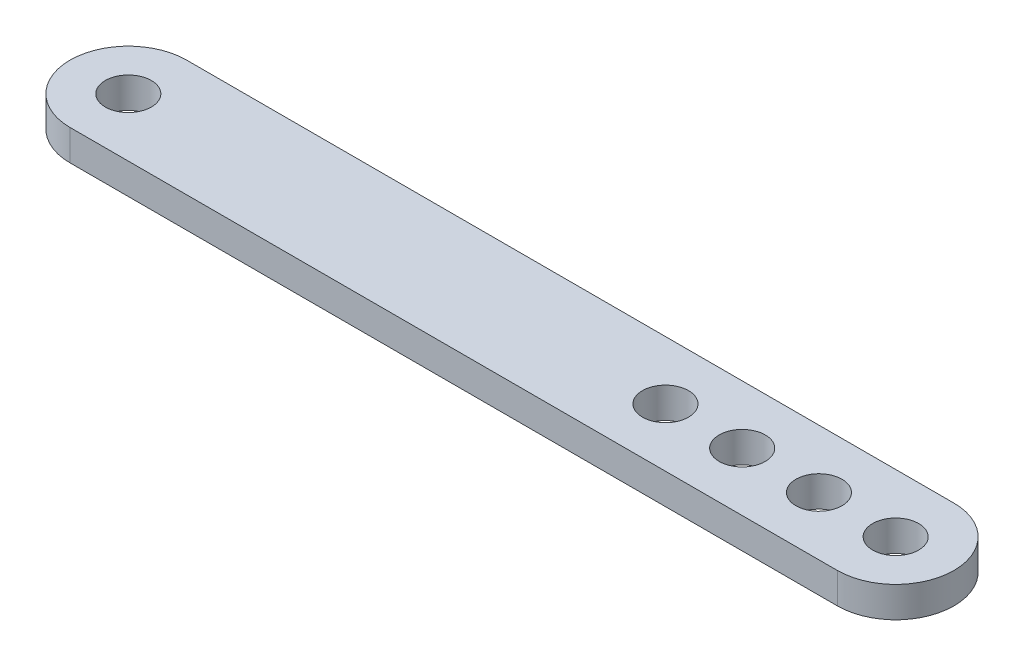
ISO-10303-21;
HEADER;
FILE_DESCRIPTION(('STEP AP214'),'2;1');
FILE_NAME('part.step','',(''),(''),'','','');
FILE_SCHEMA(('AUTOMOTIVE_DESIGN { 1 0 10303 214 1 1 1 1 }'));
ENDSEC;
DATA;
#1=APPLICATION_CONTEXT('core data for automotive mechanical design processes');
#2=APPLICATION_PROTOCOL_DEFINITION('international standard','automotive_design',2000,#1);
#3=PRODUCT_CONTEXT('',#1,'mechanical');
#4=PRODUCT('Part','Part','',(#3));
#5=PRODUCT_RELATED_PRODUCT_CATEGORY('part','',(#4));
#6=PRODUCT_DEFINITION_FORMATION('','',#4);
#7=PRODUCT_DEFINITION_CONTEXT('part definition',#1,'design');
#8=PRODUCT_DEFINITION('design','',#6,#7);
#9=PRODUCT_DEFINITION_SHAPE('','',#8);
#10=(LENGTH_UNIT() NAMED_UNIT(*) SI_UNIT(.MILLI.,.METRE.));
#11=(NAMED_UNIT(*) PLANE_ANGLE_UNIT() SI_UNIT($,.RADIAN.));
#12=(NAMED_UNIT(*) SI_UNIT($,.STERADIAN.) SOLID_ANGLE_UNIT());
#13=UNCERTAINTY_MEASURE_WITH_UNIT(LENGTH_MEASURE(1.E-05),#10,'distance_accuracy_value','');
#14=(GEOMETRIC_REPRESENTATION_CONTEXT(3) GLOBAL_UNCERTAINTY_ASSIGNED_CONTEXT((#13)) GLOBAL_UNIT_ASSIGNED_CONTEXT((#10,
#11,#12)) REPRESENTATION_CONTEXT('',''));
#15=CARTESIAN_POINT('',(0.,0.,0.));
#16=DIRECTION('',(0.,0.,1.));
#17=DIRECTION('',(1.,0.,0.));
#18=AXIS2_PLACEMENT_3D('',#15,#16,#17);
#19=CARTESIAN_POINT('',(0.,2.,3.8));
#20=DIRECTION('',(0.,0.,1.));
#21=DIRECTION('',(1.,0.,0.));
#22=AXIS2_PLACEMENT_3D('',#19,#20,#21);
#23=PLANE('',#22);
#24=DIRECTION('',(-1.,0.,0.));
#25=VECTOR('',#24,1.);
#26=CARTESIAN_POINT('',(0.,0.,3.8));
#27=LINE('',#26,#25);
#28=CARTESIAN_POINT('',(25.,0.,3.8));
#29=VERTEX_POINT('',#28);
#30=CARTESIAN_POINT('',(-25.,0.,3.8));
#31=VERTEX_POINT('',#30);
#32=EDGE_CURVE('E125',#29,#31,#27,.T.);
#33=ORIENTED_EDGE('',*,*,#32,.F.);
#34=DIRECTION('',(0.,-1.,0.));
#35=VECTOR('',#34,1.);
#36=CARTESIAN_POINT('',(25.,2.,3.8));
#37=LINE('',#36,#35);
#38=CARTESIAN_POINT('',(25.,2.,3.8));
#39=VERTEX_POINT('',#38);
#40=EDGE_CURVE('E11',#39,#29,#37,.T.);
#41=ORIENTED_EDGE('',*,*,#40,.F.);
#42=DIRECTION('',(-1.,0.,0.));
#43=VECTOR('',#42,1.);
#44=CARTESIAN_POINT('',(0.,2.,3.8));
#45=LINE('',#44,#43);
#46=CARTESIAN_POINT('',(-25.,2.,3.8));
#47=VERTEX_POINT('',#46);
#48=EDGE_CURVE('E104',#39,#47,#45,.T.);
#49=ORIENTED_EDGE('',*,*,#48,.T.);
#50=DIRECTION('',(0.,-1.,0.));
#51=VECTOR('',#50,1.);
#52=CARTESIAN_POINT('',(-25.,2.,3.8));
#53=LINE('',#52,#51);
#54=EDGE_CURVE('E85',#47,#31,#53,.T.);
#55=ORIENTED_EDGE('',*,*,#54,.T.);
#56=EDGE_LOOP('',(#33,#41,#49,#55));
#57=FACE_BOUND('',#56,.T.);
#58=ADVANCED_FACE('F45',(#57),#23,.T.);
#59=CARTESIAN_POINT('',(25.,2.,0.));
#60=DIRECTION('',(0.,-1.,0.));
#61=DIRECTION('',(0.,0.,-1.));
#62=AXIS2_PLACEMENT_3D('',#59,#60,#61);
#63=CYLINDRICAL_SURFACE('',#62,3.8);
#64=CARTESIAN_POINT('',(25.,0.,0.));
#65=DIRECTION('',(0.,1.,0.));
#66=DIRECTION('',(0.,0.,1.));
#67=AXIS2_PLACEMENT_3D('',#64,#65,#66);
#68=CIRCLE('',#67,3.8);
#69=CARTESIAN_POINT('',(25.,0.,-3.8));
#70=VERTEX_POINT('',#69);
#71=EDGE_CURVE('E110',#29,#70,#68,.T.);
#72=ORIENTED_EDGE('',*,*,#71,.T.);
#73=DIRECTION('',(0.,-1.,0.));
#74=VECTOR('',#73,1.);
#75=CARTESIAN_POINT('',(25.,2.,-3.8));
#76=LINE('',#75,#74);
#77=CARTESIAN_POINT('',(25.,2.,-3.8));
#78=VERTEX_POINT('',#77);
#79=EDGE_CURVE('E55',#78,#70,#76,.T.);
#80=ORIENTED_EDGE('',*,*,#79,.F.);
#81=CARTESIAN_POINT('',(25.,2.,0.));
#82=DIRECTION('',(0.,1.,0.));
#83=DIRECTION('',(0.,0.,1.));
#84=AXIS2_PLACEMENT_3D('',#81,#82,#83);
#85=CIRCLE('',#84,3.8);
#86=EDGE_CURVE('E101',#39,#78,#85,.T.);
#87=ORIENTED_EDGE('',*,*,#86,.F.);
#88=ORIENTED_EDGE('',*,*,#40,.T.);
#89=EDGE_LOOP('',(#72,#80,#87,#88));
#90=FACE_BOUND('',#89,.T.);
#91=ADVANCED_FACE('F108',(#90),#63,.T.);
#92=CARTESIAN_POINT('',(0.,2.,-3.8));
#93=DIRECTION('',(0.,0.,1.));
#94=DIRECTION('',(1.,0.,0.));
#95=AXIS2_PLACEMENT_3D('',#92,#93,#94);
#96=PLANE('',#95);
#97=DIRECTION('',(-1.,0.,0.));
#98=VECTOR('',#97,1.);
#99=CARTESIAN_POINT('',(0.,0.,-3.8));
#100=LINE('',#99,#98);
#101=CARTESIAN_POINT('',(-25.,0.,-3.8));
#102=VERTEX_POINT('',#101);
#103=EDGE_CURVE('E120',#70,#102,#100,.T.);
#104=ORIENTED_EDGE('',*,*,#103,.T.);
#105=DIRECTION('',(0.,-1.,0.));
#106=VECTOR('',#105,1.);
#107=CARTESIAN_POINT('',(-25.,2.,-3.8));
#108=LINE('',#107,#106);
#109=CARTESIAN_POINT('',(-25.,2.,-3.8));
#110=VERTEX_POINT('',#109);
#111=EDGE_CURVE('E99',#110,#102,#108,.T.);
#112=ORIENTED_EDGE('',*,*,#111,.F.);
#113=DIRECTION('',(-1.,0.,0.));
#114=VECTOR('',#113,1.);
#115=CARTESIAN_POINT('',(0.,2.,-3.8));
#116=LINE('',#115,#114);
#117=EDGE_CURVE('E93',#78,#110,#116,.T.);
#118=ORIENTED_EDGE('',*,*,#117,.F.);
#119=ORIENTED_EDGE('',*,*,#79,.T.);
#120=EDGE_LOOP('',(#104,#112,#118,#119));
#121=FACE_BOUND('',#120,.T.);
#122=ADVANCED_FACE('F96',(#121),#96,.F.);
#123=CARTESIAN_POINT('',(15.,2.,0.));
#124=DIRECTION('',(0.,-1.,0.));
#125=DIRECTION('',(0.,0.,-1.));
#126=AXIS2_PLACEMENT_3D('',#123,#124,#125);
#127=CYLINDRICAL_SURFACE('',#126,1.5);
#128=CARTESIAN_POINT('',(15.,2.,0.));
#129=DIRECTION('',(0.,1.,0.));
#130=DIRECTION('',(0.,0.,1.));
#131=AXIS2_PLACEMENT_3D('',#128,#129,#130);
#132=CIRCLE('',#131,1.5);
#133=CARTESIAN_POINT('',(15.,2.,1.50000000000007));
#134=VERTEX_POINT('',#133);
#135=EDGE_CURVE('E152',#134,#134,#132,.T.);
#136=ORIENTED_EDGE('',*,*,#135,.T.);
#137=EDGE_LOOP('',(#136));
#138=FACE_BOUND('',#137,.T.);
#139=CARTESIAN_POINT('',(15.,0.,0.));
#140=DIRECTION('',(0.,1.,0.));
#141=DIRECTION('',(0.,0.,1.));
#142=AXIS2_PLACEMENT_3D('',#139,#140,#141);
#143=CIRCLE('',#142,1.5);
#144=CARTESIAN_POINT('',(15.,0.,1.50000000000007));
#145=VERTEX_POINT('',#144);
#146=EDGE_CURVE('E128',#145,#145,#143,.T.);
#147=ORIENTED_EDGE('',*,*,#146,.F.);
#148=EDGE_LOOP('',(#147));
#149=FACE_BOUND('',#148,.T.);
#150=ADVANCED_FACE('F187',(#138,#149),#127,.F.);
#151=CARTESIAN_POINT('',(10.,2.,1.07310574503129E-13));
#152=DIRECTION('',(0.,-1.,0.));
#153=DIRECTION('',(0.,0.,-1.));
#154=AXIS2_PLACEMENT_3D('',#151,#152,#153);
#155=CYLINDRICAL_SURFACE('',#154,1.5);
#156=CARTESIAN_POINT('',(10.,2.,1.07310574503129E-13));
#157=DIRECTION('',(0.,1.,0.));
#158=DIRECTION('',(0.,0.,1.));
#159=AXIS2_PLACEMENT_3D('',#156,#157,#158);
#160=CIRCLE('',#159,1.5);
#161=CARTESIAN_POINT('',(10.,2.,1.50000000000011));
#162=VERTEX_POINT('',#161);
#163=EDGE_CURVE('E156',#162,#162,#160,.T.);
#164=ORIENTED_EDGE('',*,*,#163,.T.);
#165=EDGE_LOOP('',(#164));
#166=FACE_BOUND('',#165,.T.);
#167=CARTESIAN_POINT('',(10.,0.,1.07310574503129E-13));
#168=DIRECTION('',(0.,1.,0.));
#169=DIRECTION('',(0.,0.,1.));
#170=AXIS2_PLACEMENT_3D('',#167,#168,#169);
#171=CIRCLE('',#170,1.5);
#172=CARTESIAN_POINT('',(10.,0.,1.50000000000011));
#173=VERTEX_POINT('',#172);
#174=EDGE_CURVE('E132',#173,#173,#171,.T.);
#175=ORIENTED_EDGE('',*,*,#174,.F.);
#176=EDGE_LOOP('',(#175));
#177=FACE_BOUND('',#176,.T.);
#178=ADVANCED_FACE('F190',(#166,#177),#155,.F.);
#179=CARTESIAN_POINT('',(20.,2.,0.));
#180=DIRECTION('',(0.,-1.,0.));
#181=DIRECTION('',(0.,0.,-1.));
#182=AXIS2_PLACEMENT_3D('',#179,#180,#181);
#183=CYLINDRICAL_SURFACE('',#182,1.5);
#184=CARTESIAN_POINT('',(20.,2.,0.));
#185=DIRECTION('',(0.,1.,0.));
#186=DIRECTION('',(0.,0.,1.));
#187=AXIS2_PLACEMENT_3D('',#184,#185,#186);
#188=CIRCLE('',#187,1.5);
#189=CARTESIAN_POINT('',(20.,2.,1.50000000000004));
#190=VERTEX_POINT('',#189);
#191=EDGE_CURVE('E160',#190,#190,#188,.T.);
#192=ORIENTED_EDGE('',*,*,#191,.T.);
#193=EDGE_LOOP('',(#192));
#194=FACE_BOUND('',#193,.T.);
#195=CARTESIAN_POINT('',(20.,0.,0.));
#196=DIRECTION('',(0.,1.,0.));
#197=DIRECTION('',(0.,0.,1.));
#198=AXIS2_PLACEMENT_3D('',#195,#196,#197);
#199=CIRCLE('',#198,1.5);
#200=CARTESIAN_POINT('',(20.,0.,1.50000000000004));
#201=VERTEX_POINT('',#200);
#202=EDGE_CURVE('E136',#201,#201,#199,.T.);
#203=ORIENTED_EDGE('',*,*,#202,.F.);
#204=EDGE_LOOP('',(#203));
#205=FACE_BOUND('',#204,.T.);
#206=ADVANCED_FACE('F207',(#194,#205),#183,.F.);
#207=CARTESIAN_POINT('',(25.,2.,0.));
#208=DIRECTION('',(0.,-1.,0.));
#209=DIRECTION('',(0.,0.,-1.));
#210=AXIS2_PLACEMENT_3D('',#207,#208,#209);
#211=CYLINDRICAL_SURFACE('',#210,1.5);
#212=CARTESIAN_POINT('',(25.,2.,0.));
#213=DIRECTION('',(0.,1.,0.));
#214=DIRECTION('',(0.,0.,1.));
#215=AXIS2_PLACEMENT_3D('',#212,#213,#214);
#216=CIRCLE('',#215,1.5);
#217=CARTESIAN_POINT('',(25.,2.,1.5));
#218=VERTEX_POINT('',#217);
#219=EDGE_CURVE('E164',#218,#218,#216,.T.);
#220=ORIENTED_EDGE('',*,*,#219,.T.);
#221=EDGE_LOOP('',(#220));
#222=FACE_BOUND('',#221,.T.);
#223=CARTESIAN_POINT('',(25.,0.,0.));
#224=DIRECTION('',(0.,1.,0.));
#225=DIRECTION('',(0.,0.,1.));
#226=AXIS2_PLACEMENT_3D('',#223,#224,#225);
#227=CIRCLE('',#226,1.5);
#228=CARTESIAN_POINT('',(25.,0.,1.5));
#229=VERTEX_POINT('',#228);
#230=EDGE_CURVE('E140',#229,#229,#227,.T.);
#231=ORIENTED_EDGE('',*,*,#230,.F.);
#232=EDGE_LOOP('',(#231));
#233=FACE_BOUND('',#232,.T.);
#234=ADVANCED_FACE('F210',(#222,#233),#211,.F.);
#235=CARTESIAN_POINT('',(-25.,2.,0.));
#236=DIRECTION('',(0.,-1.,0.));
#237=DIRECTION('',(0.,0.,-1.));
#238=AXIS2_PLACEMENT_3D('',#235,#236,#237);
#239=CYLINDRICAL_SURFACE('',#238,1.5);
#240=CARTESIAN_POINT('',(-25.,2.,0.));
#241=DIRECTION('',(0.,1.,0.));
#242=DIRECTION('',(0.,0.,1.));
#243=AXIS2_PLACEMENT_3D('',#240,#241,#242);
#244=CIRCLE('',#243,1.5);
#245=CARTESIAN_POINT('',(-25.,2.,1.5));
#246=VERTEX_POINT('',#245);
#247=EDGE_CURVE('E119',#246,#246,#244,.T.);
#248=ORIENTED_EDGE('',*,*,#247,.T.);
#249=EDGE_LOOP('',(#248));
#250=FACE_BOUND('',#249,.T.);
#251=CARTESIAN_POINT('',(-25.,0.,0.));
#252=DIRECTION('',(0.,1.,0.));
#253=DIRECTION('',(0.,0.,1.));
#254=AXIS2_PLACEMENT_3D('',#251,#252,#253);
#255=CIRCLE('',#254,1.5);
#256=CARTESIAN_POINT('',(-25.,0.,1.5));
#257=VERTEX_POINT('',#256);
#258=EDGE_CURVE('E144',#257,#257,#255,.T.);
#259=ORIENTED_EDGE('',*,*,#258,.F.);
#260=EDGE_LOOP('',(#259));
#261=FACE_BOUND('',#260,.T.);
#262=ADVANCED_FACE('F47',(#250,#261),#239,.F.);
#263=CARTESIAN_POINT('',(-25.,2.,0.));
#264=DIRECTION('',(0.,-1.,0.));
#265=DIRECTION('',(0.,0.,-1.));
#266=AXIS2_PLACEMENT_3D('',#263,#264,#265);
#267=CYLINDRICAL_SURFACE('',#266,3.8);
#268=CARTESIAN_POINT('',(-25.,0.,0.));
#269=DIRECTION('',(0.,1.,0.));
#270=DIRECTION('',(0.,0.,1.));
#271=AXIS2_PLACEMENT_3D('',#268,#269,#270);
#272=CIRCLE('',#271,3.8);
#273=EDGE_CURVE('E78',#102,#31,#272,.T.);
#274=ORIENTED_EDGE('',*,*,#273,.T.);
#275=ORIENTED_EDGE('',*,*,#54,.F.);
#276=CARTESIAN_POINT('',(-25.,2.,0.));
#277=DIRECTION('',(0.,1.,0.));
#278=DIRECTION('',(0.,0.,1.));
#279=AXIS2_PLACEMENT_3D('',#276,#277,#278);
#280=CIRCLE('',#279,3.8);
#281=EDGE_CURVE('E63',#110,#47,#280,.T.);
#282=ORIENTED_EDGE('',*,*,#281,.F.);
#283=ORIENTED_EDGE('',*,*,#111,.T.);
#284=EDGE_LOOP('',(#274,#275,#282,#283));
#285=FACE_BOUND('',#284,.T.);
#286=ADVANCED_FACE('F177',(#285),#267,.T.);
#287=CARTESIAN_POINT('',(0.,2.,0.));
#288=DIRECTION('',(0.,1.,0.));
#289=DIRECTION('',(0.,0.,1.));
#290=AXIS2_PLACEMENT_3D('',#287,#288,#289);
#291=PLANE('',#290);
#292=ORIENTED_EDGE('',*,*,#247,.F.);
#293=EDGE_LOOP('',(#292));
#294=FACE_BOUND('',#293,.T.);
#295=ORIENTED_EDGE('',*,*,#219,.F.);
#296=EDGE_LOOP('',(#295));
#297=FACE_BOUND('',#296,.T.);
#298=ORIENTED_EDGE('',*,*,#191,.F.);
#299=EDGE_LOOP('',(#298));
#300=FACE_BOUND('',#299,.T.);
#301=ORIENTED_EDGE('',*,*,#163,.F.);
#302=EDGE_LOOP('',(#301));
#303=FACE_BOUND('',#302,.T.);
#304=ORIENTED_EDGE('',*,*,#135,.F.);
#305=EDGE_LOOP('',(#304));
#306=FACE_BOUND('',#305,.T.);
#307=ORIENTED_EDGE('',*,*,#48,.F.);
#308=ORIENTED_EDGE('',*,*,#86,.T.);
#309=ORIENTED_EDGE('',*,*,#117,.T.);
#310=ORIENTED_EDGE('',*,*,#281,.T.);
#311=EDGE_LOOP('',(#307,#308,#309,#310));
#312=FACE_BOUND('',#311,.T.);
#313=ADVANCED_FACE('F103',(#294,#297,#300,#303,#306,#312),#291,.T.);
#314=CARTESIAN_POINT('',(0.,0.,0.));
#315=DIRECTION('',(0.,1.,0.));
#316=DIRECTION('',(0.,0.,1.));
#317=AXIS2_PLACEMENT_3D('',#314,#315,#316);
#318=PLANE('',#317);
#319=ORIENTED_EDGE('',*,*,#258,.T.);
#320=EDGE_LOOP('',(#319));
#321=FACE_BOUND('',#320,.T.);
#322=ORIENTED_EDGE('',*,*,#230,.T.);
#323=EDGE_LOOP('',(#322));
#324=FACE_BOUND('',#323,.T.);
#325=ORIENTED_EDGE('',*,*,#202,.T.);
#326=EDGE_LOOP('',(#325));
#327=FACE_BOUND('',#326,.T.);
#328=ORIENTED_EDGE('',*,*,#174,.T.);
#329=EDGE_LOOP('',(#328));
#330=FACE_BOUND('',#329,.T.);
#331=ORIENTED_EDGE('',*,*,#146,.T.);
#332=EDGE_LOOP('',(#331));
#333=FACE_BOUND('',#332,.T.);
#334=ORIENTED_EDGE('',*,*,#32,.T.);
#335=ORIENTED_EDGE('',*,*,#273,.F.);
#336=ORIENTED_EDGE('',*,*,#103,.F.);
#337=ORIENTED_EDGE('',*,*,#71,.F.);
#338=EDGE_LOOP('',(#334,#335,#336,#337));
#339=FACE_BOUND('',#338,.T.);
#340=ADVANCED_FACE('F176',(#321,#324,#327,#330,#333,#339),#318,.F.);
#341=CLOSED_SHELL('',(#58,#91,#122,#150,#178,#206,#234,#262,#286,#313,#340));
#342=MANIFOLD_SOLID_BREP('B2',#341);
#343=ADVANCED_BREP_SHAPE_REPRESENTATION('',(#18,#342),#14);
#344=SHAPE_DEFINITION_REPRESENTATION(#9,#343);
ENDSEC;
END-ISO-10303-21;
